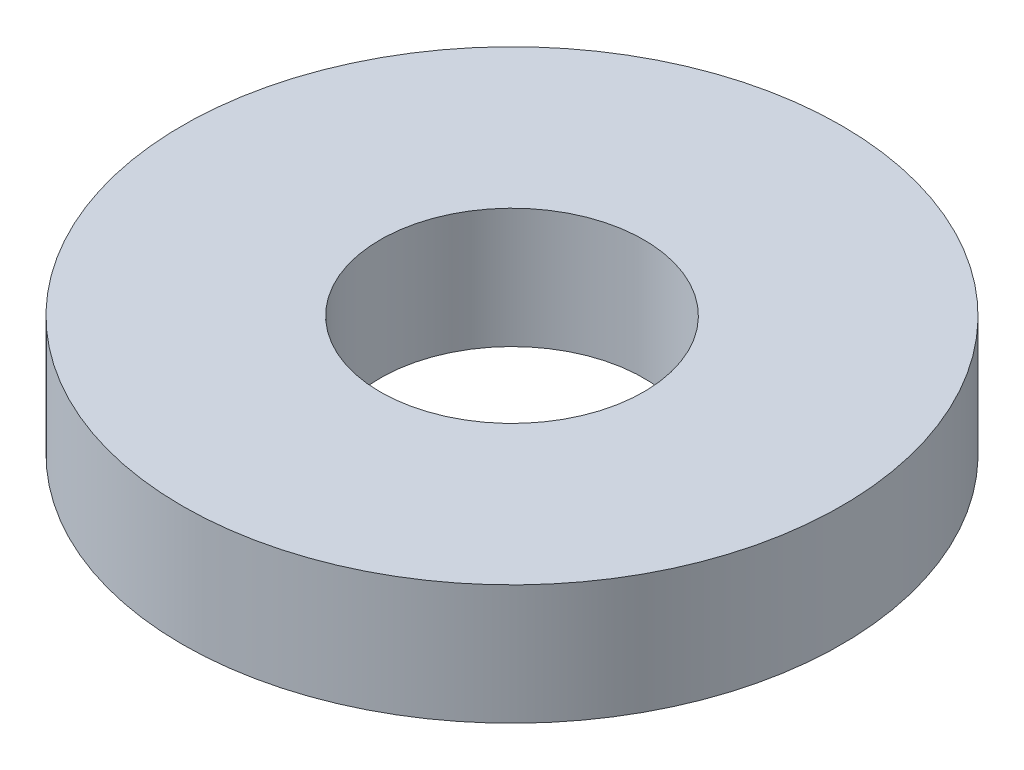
from build123d import *

# Parameters (mm, degrees)
SKETCH_1_R          = 2.75
EXTRUDE_1_DEPTH     = 1
SKETCH_2_R          = 1.1
CUT_EXTRUDE_1_DEPTH = 1


with BuildPart() as part:
    # Sketch 1 → Extrude 1 (new body)
    with BuildSketch(Plane(origin=(0, 0, 0), x_dir=(1, 0, 0), z_dir=(0, 1, 0))):
        with Locations(Location((0, 0, 0), (0, 0, 270))):
            Circle(SKETCH_1_R)
    extrude(amount=EXTRUDE_1_DEPTH)

    # Sketch 2 → Cut-Extrude 1 (cut)
    with BuildSketch(Plane(origin=(0, 1, 0), x_dir=(1, 0, 0), z_dir=(0, 1, 0))):
        with Locations(Location((0, 0, 0), (0, 0, 270))):
            Circle(SKETCH_2_R)
    extrude(amount=-CUT_EXTRUDE_1_DEPTH, mode=Mode.SUBTRACT)


solid = part.part
